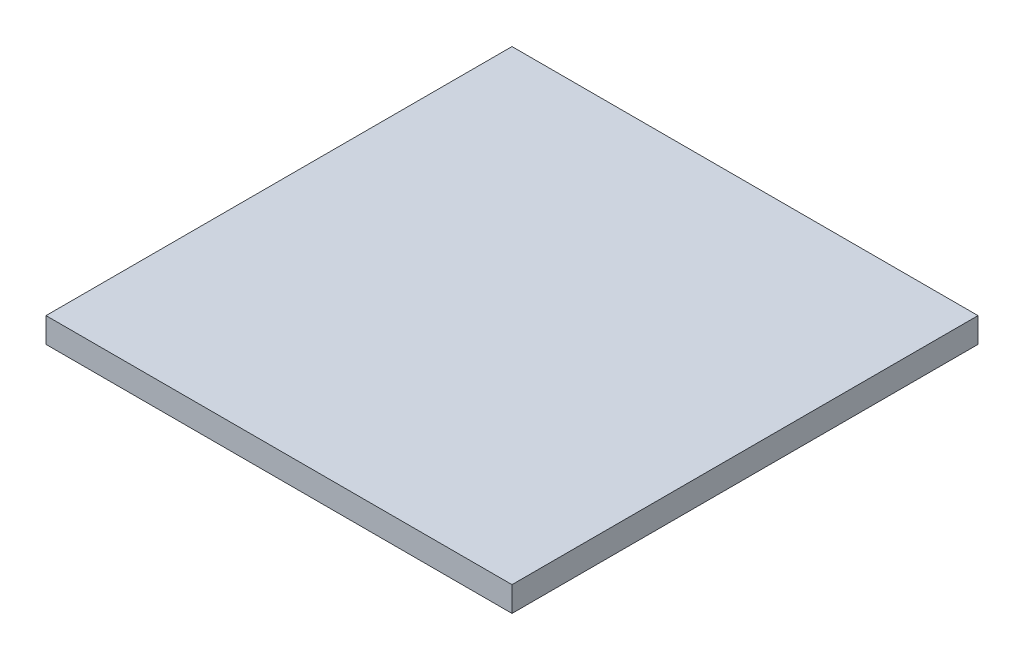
from build123d import *

# Parameters (mm, degrees)
SKETCH1_W           = 88.9
SKETCH1_H           = 88.9
BOSS_EXTRUDE1_DEPTH = 4.7625


with BuildPart() as part:
    # Sketch1 → Boss-Extrude1 (new body)
    with BuildSketch(Plane(origin=(0, 0, 0), x_dir=(1, 0, 0), z_dir=(0, 1, 0))):
        with Locations((44.45, 44.45)):
            Rectangle(SKETCH1_W, SKETCH1_H)
    extrude(amount=BOSS_EXTRUDE1_DEPTH)


solid = part.part
